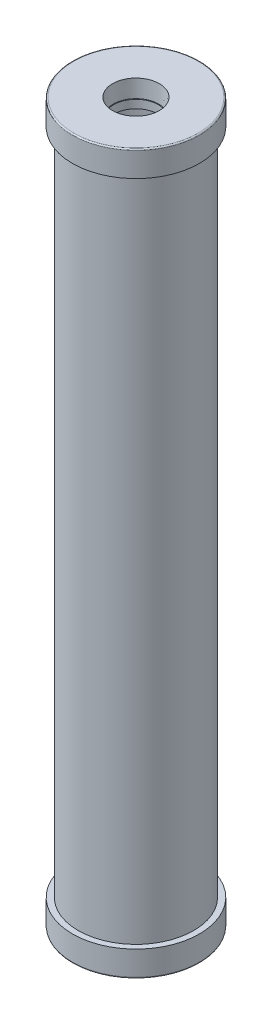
from build123d import *

# Parameters (mm, degrees)
SKETCH1_R           = 57.15
SKETCH1_R_2         = 50.546
BOSS_EXTRUDE1_DEPTH = 711.2
SKETCH2_R           = 62.865
BOSS_EXTRUDE2_DEPTH = 25.4
BOSS_EXTRUDE3_START = -25.4
SKETCH5_R           = 62.865
BOSS_EXTRUDE3_DEPTH = 25.4
FILLET1_R           = 1.27


with BuildPart() as part:
    # Sketch1 → Boss-Extrude1 (new body)
    with BuildSketch(Plane(origin=(0, 0, 0), x_dir=(1, 0, 0), z_dir=(0, 1, 0))):
        with Locations(Location((0, 0, 0), (0, 0, 270))):
            Circle(SKETCH1_R)
        with Locations(Location((0, 0, 0), (0, 0, 270))):
            Circle(SKETCH1_R_2, mode=Mode.SUBTRACT)
    extrude(amount=BOSS_EXTRUDE1_DEPTH)

    # Sketch2 → Boss-Extrude2 (add)
    with BuildSketch(Plane(origin=(0, 0, 0), x_dir=(1, 0, 0), z_dir=(0, 1, 0))):
        with Locations(Location((0, 0, 0), (0, 0, 270))):
            Circle(SKETCH2_R)
    extrude(amount=BOSS_EXTRUDE2_DEPTH)

    # Sketch3 → 1-1_2 NPT Tapped Hole1 (revolve, cut)
    with BuildSketch(Plane(origin=(0, 0, 0), x_dir=(0, 0, -1), z_dir=(1, 0, 0))):
        Polygon((0, 0), (0, 41.565568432), (21.8313, 28.448), (21.8313, 17.272), (22.62588539, 17.272), (23.1430322, 0), align=None)
    revolve(axis=Axis((0, -6.35, 0), (0, 1, 0)), mode=Mode.SUBTRACT)

    # Sketch5 → Boss-Extrude3 (add)
    with BuildSketch(Plane(origin=(0, 711.2, 0), x_dir=(1, 0, 0), z_dir=(0, 1, 0)).offset(BOSS_EXTRUDE3_START)):
        with Locations(Location((0, 0, 0), (0, 0, 270))):
            Circle(SKETCH5_R)
    extrude(amount=BOSS_EXTRUDE3_DEPTH)

    # Sketch6 → 1-1_2 NPT Tapped Hole2 (revolve, cut)
    with BuildSketch(Plane(origin=(0, 711.2, 0), x_dir=(0, 0, 1), z_dir=(1, 0, 0))):
        Polygon((0, 0), (0, 41.565568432), (21.8313, 28.448), (21.8313, 17.272), (22.62588539, 17.272), (23.1430322, 0), align=None)
    revolve(axis=Axis((0, 717.55, 0), (0, -1, 0)), mode=Mode.SUBTRACT)

    # Fillet1
    fillet1_edges = [part.edges().sort_by_distance(p)[0] for p in [
        (0, 0, -62.865),
        (0, 711.2, -62.865),
    ]]
    fillet(fillet1_edges, radius=FILLET1_R)


solid = part.part
